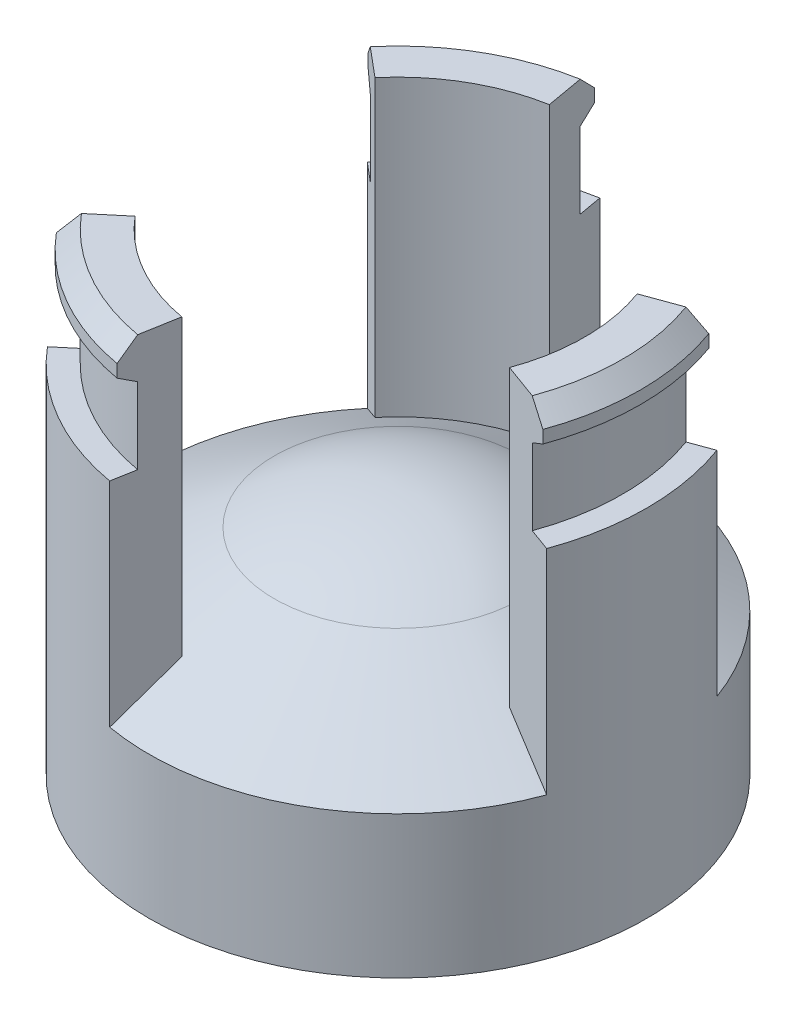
ISO-10303-21;
HEADER;
FILE_DESCRIPTION(('STEP AP214'),'2;1');
FILE_NAME('part.step','',(''),(''),'','','');
FILE_SCHEMA(('AUTOMOTIVE_DESIGN { 1 0 10303 214 1 1 1 1 }'));
ENDSEC;
DATA;
#1=APPLICATION_CONTEXT('core data for automotive mechanical design processes');
#2=APPLICATION_PROTOCOL_DEFINITION('international standard','automotive_design',2000,#1);
#3=PRODUCT_CONTEXT('',#1,'mechanical');
#4=PRODUCT('Part','Part','',(#3));
#5=PRODUCT_RELATED_PRODUCT_CATEGORY('part','',(#4));
#6=PRODUCT_DEFINITION_FORMATION('','',#4);
#7=PRODUCT_DEFINITION_CONTEXT('part definition',#1,'design');
#8=PRODUCT_DEFINITION('design','',#6,#7);
#9=PRODUCT_DEFINITION_SHAPE('','',#8);
#10=(LENGTH_UNIT() NAMED_UNIT(*) SI_UNIT(.MILLI.,.METRE.));
#11=(NAMED_UNIT(*) PLANE_ANGLE_UNIT() SI_UNIT($,.RADIAN.));
#12=(NAMED_UNIT(*) SI_UNIT($,.STERADIAN.) SOLID_ANGLE_UNIT());
#13=UNCERTAINTY_MEASURE_WITH_UNIT(LENGTH_MEASURE(1.E-05),#10,'distance_accuracy_value','');
#14=(GEOMETRIC_REPRESENTATION_CONTEXT(3) GLOBAL_UNCERTAINTY_ASSIGNED_CONTEXT((#13)) GLOBAL_UNIT_ASSIGNED_CONTEXT((#10,
#11,#12)) REPRESENTATION_CONTEXT('',''));
#15=CARTESIAN_POINT('',(0.,0.,0.));
#16=DIRECTION('',(0.,0.,1.));
#17=DIRECTION('',(1.,0.,0.));
#18=AXIS2_PLACEMENT_3D('',#15,#16,#17);
#19=CARTESIAN_POINT('',(0.,0.,0.));
#20=DIRECTION('',(0.,-1.,0.));
#21=DIRECTION('',(1.,0.,0.));
#22=AXIS2_PLACEMENT_3D('',#19,#20,#21);
#23=SPHERICAL_SURFACE('',#22,8.25);
#24=CARTESIAN_POINT('',(0.,0.,0.));
#25=DIRECTION('',(0.,-1.,0.));
#26=DIRECTION('',(0.,0.,-1.));
#27=AXIS2_PLACEMENT_3D('',#24,#25,#26);
#28=CIRCLE('',#27,8.25);
#29=CARTESIAN_POINT('',(0.,0.,-8.25));
#30=VERTEX_POINT('',#29);
#31=EDGE_CURVE('E491',#30,#30,#28,.T.);
#32=ORIENTED_EDGE('',*,*,#31,.T.);
#33=EDGE_LOOP('',(#32));
#34=FACE_BOUND('',#33,.T.);
#35=ADVANCED_FACE('F39',(#34),#23,.F.);
#36=CARTESIAN_POINT('',(0.,0.,0.));
#37=DIRECTION('',(0.,-1.,0.));
#38=DIRECTION('',(1.,0.,0.));
#39=AXIS2_PLACEMENT_3D('',#36,#37,#38);
#40=SPHERICAL_SURFACE('',#39,9.74974226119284);
#41=CARTESIAN_POINT('',(0.,8.44352447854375,0.));
#42=DIRECTION('',(0.,-1.,0.));
#43=DIRECTION('',(0.,0.,-1.));
#44=AXIS2_PLACEMENT_3D('',#41,#42,#43);
#45=CIRCLE('',#44,4.8748711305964);
#46=CARTESIAN_POINT('',(0.,8.44352447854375,-4.8748711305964));
#47=VERTEX_POINT('',#46);
#48=EDGE_CURVE('E503',#47,#47,#45,.T.);
#49=ORIENTED_EDGE('',*,*,#48,.F.);
#50=EDGE_LOOP('',(#49));
#51=FACE_BOUND('',#50,.T.);
#52=ADVANCED_FACE('F606',(#51),#40,.T.);
#53=CARTESIAN_POINT('',(0.,5.6,0.));
#54=DIRECTION('',(0.,-1.,0.));
#55=DIRECTION('',(0.,0.,-1.));
#56=AXIS2_PLACEMENT_3D('',#53,#54,#55);
#57=CONICAL_SURFACE('',#56,9.8,1.0471975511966);
#58=DIRECTION('',(-0.663413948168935,-0.499999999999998,-0.556670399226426));
#59=VECTOR('',#58,1.);
#60=CARTESIAN_POINT('',(0.,11.2580326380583,0.));
#61=LINE('',#60,#59);
#62=CARTESIAN_POINT('',(-7.50723554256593,5.6,-6.29931857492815));
#63=VERTEX_POINT('',#62);
#64=CARTESIAN_POINT('',(-5.63042665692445,7.01450815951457,-4.72448893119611));
#65=VERTEX_POINT('',#64);
#66=EDGE_CURVE('E313',#63,#65,#61,.F.);
#67=ORIENTED_EDGE('',*,*,#66,.F.);
#68=CARTESIAN_POINT('',(0.,5.6,0.));
#69=DIRECTION('',(0.,-1.,0.));
#70=DIRECTION('',(0.,0.,-1.));
#71=AXIS2_PLACEMENT_3D('',#68,#69,#70);
#72=CIRCLE('',#71,9.8);
#73=CARTESIAN_POINT('',(-7.50723554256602,5.6,6.29931857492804));
#74=VERTEX_POINT('',#73);
#75=EDGE_CURVE('E504',#74,#63,#72,.T.);
#76=ORIENTED_EDGE('',*,*,#75,.F.);
#77=DIRECTION('',(-0.663413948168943,-0.499999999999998,0.556670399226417));
#78=VECTOR('',#77,1.);
#79=CARTESIAN_POINT('',(0.,11.2580326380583,0.));
#80=LINE('',#79,#78);
#81=CARTESIAN_POINT('',(-5.63042665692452,7.01450815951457,4.72448893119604));
#82=VERTEX_POINT('',#81);
#83=EDGE_CURVE('E399',#74,#82,#80,.F.);
#84=ORIENTED_EDGE('',*,*,#83,.T.);
#85=CARTESIAN_POINT('',(0.,7.01450815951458,0.));
#86=DIRECTION('',(0.,-1.,0.));
#87=DIRECTION('',(0.,0.,-1.));
#88=AXIS2_PLACEMENT_3D('',#85,#86,#87);
#89=CIRCLE('',#88,7.35);
#90=CARTESIAN_POINT('',(-1.27631410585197,7.01450815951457,7.23833698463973));
#91=VERTEX_POINT('',#90);
#92=EDGE_CURVE('E47',#91,#82,#89,.T.);
#93=ORIENTED_EDGE('',*,*,#92,.F.);
#94=DIRECTION('',(-0.150383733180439,-0.499999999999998,0.852868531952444));
#95=VECTOR('',#94,1.);
#96=CARTESIAN_POINT('',(0.,11.2580326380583,0.));
#97=LINE('',#96,#95);
#98=CARTESIAN_POINT('',(-1.70175214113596,5.6,9.65111597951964));
#99=VERTEX_POINT('',#98);
#100=EDGE_CURVE('E403',#99,#91,#97,.F.);
#101=ORIENTED_EDGE('',*,*,#100,.F.);
#102=CARTESIAN_POINT('',(9.2089876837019,5.6,3.35179740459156));
#103=VERTEX_POINT('',#102);
#104=EDGE_CURVE('E500',#103,#99,#72,.T.);
#105=ORIENTED_EDGE('',*,*,#104,.F.);
#106=DIRECTION('',(0.813797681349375,-0.499999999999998,0.296198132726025));
#107=VECTOR('',#106,1.);
#108=CARTESIAN_POINT('',(0.,11.2580326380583,0.));
#109=LINE('',#108,#107);
#110=CARTESIAN_POINT('',(6.90674076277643,7.01450815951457,2.51384805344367));
#111=VERTEX_POINT('',#110);
#112=EDGE_CURVE('E508',#103,#111,#109,.F.);
#113=ORIENTED_EDGE('',*,*,#112,.T.);
#114=CARTESIAN_POINT('',(0.,7.01450815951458,0.));
#115=DIRECTION('',(0.,-1.,0.));
#116=DIRECTION('',(0.,0.,-1.));
#117=AXIS2_PLACEMENT_3D('',#114,#115,#116);
#118=CIRCLE('',#117,7.35);
#119=CARTESIAN_POINT('',(6.90674076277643,7.01450815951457,-2.51384805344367));
#120=VERTEX_POINT('',#119);
#121=EDGE_CURVE('E512',#120,#111,#118,.T.);
#122=ORIENTED_EDGE('',*,*,#121,.F.);
#123=DIRECTION('',(0.813797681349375,-0.499999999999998,-0.296198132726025));
#124=VECTOR('',#123,1.);
#125=CARTESIAN_POINT('',(0.,11.2580326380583,0.));
#126=LINE('',#125,#124);
#127=CARTESIAN_POINT('',(9.2089876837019,5.6,-3.35179740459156));
#128=VERTEX_POINT('',#127);
#129=EDGE_CURVE('E515',#128,#120,#126,.F.);
#130=ORIENTED_EDGE('',*,*,#129,.F.);
#131=CARTESIAN_POINT('',(-1.70175214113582,5.6,-9.65111597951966));
#132=VERTEX_POINT('',#131);
#133=EDGE_CURVE('E499',#132,#128,#72,.T.);
#134=ORIENTED_EDGE('',*,*,#133,.F.);
#135=DIRECTION('',(-0.150383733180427,-0.499999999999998,-0.852868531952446));
#136=VECTOR('',#135,1.);
#137=CARTESIAN_POINT('',(0.,11.2580326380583,0.));
#138=LINE('',#137,#136);
#139=CARTESIAN_POINT('',(-1.27631410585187,7.01450815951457,-7.23833698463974));
#140=VERTEX_POINT('',#139);
#141=EDGE_CURVE('E236',#132,#140,#138,.F.);
#142=ORIENTED_EDGE('',*,*,#141,.T.);
#143=CARTESIAN_POINT('',(0.,7.01450815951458,0.));
#144=DIRECTION('',(0.,-1.,0.));
#145=DIRECTION('',(0.,0.,-1.));
#146=AXIS2_PLACEMENT_3D('',#143,#144,#145);
#147=CIRCLE('',#146,7.35);
#148=EDGE_CURVE('E11',#65,#140,#147,.T.);
#149=ORIENTED_EDGE('',*,*,#148,.F.);
#150=EDGE_LOOP('',(#67,#76,#84,#93,#101,#105,#113,#122,#130,#134,#142,#149));
#151=FACE_BOUND('',#150,.T.);
#152=ORIENTED_EDGE('',*,*,#48,.T.);
#153=EDGE_LOOP('',(#152));
#154=FACE_BOUND('',#153,.T.);
#155=ADVANCED_FACE('F530',(#151,#154),#57,.T.);
#156=CARTESIAN_POINT('',(0.,8.25,0.));
#157=DIRECTION('',(0.,-1.,0.));
#158=DIRECTION('',(0.,0.,-1.));
#159=AXIS2_PLACEMENT_3D('',#156,#157,#158);
#160=CYLINDRICAL_SURFACE('',#159,9.8);
#161=ORIENTED_EDGE('',*,*,#104,.T.);
#162=DIRECTION('',(0.,1.,0.));
#163=VECTOR('',#162,1.);
#164=CARTESIAN_POINT('',(-1.70175214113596,14.,9.65111597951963));
#165=LINE('',#164,#163);
#166=CARTESIAN_POINT('',(-1.70175214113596,14.,9.65111597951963));
#167=VERTEX_POINT('',#166);
#168=EDGE_CURVE('E346',#99,#167,#165,.T.);
#169=ORIENTED_EDGE('',*,*,#168,.T.);
#170=CARTESIAN_POINT('',(0.,14.,0.));
#171=DIRECTION('',(0.,-1.,0.));
#172=DIRECTION('',(0.866025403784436,0.,0.500000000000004));
#173=AXIS2_PLACEMENT_3D('',#170,#171,#172);
#174=CIRCLE('',#173,9.8);
#175=CARTESIAN_POINT('',(-7.50723554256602,14.,6.29931857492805));
#176=VERTEX_POINT('',#175);
#177=EDGE_CURVE('E378',#167,#176,#174,.T.);
#178=ORIENTED_EDGE('',*,*,#177,.T.);
#179=DIRECTION('',(0.,1.,0.));
#180=VECTOR('',#179,1.);
#181=CARTESIAN_POINT('',(-7.50723554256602,14.,6.29931857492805));
#182=LINE('',#181,#180);
#183=EDGE_CURVE('E61',#74,#176,#182,.T.);
#184=ORIENTED_EDGE('',*,*,#183,.F.);
#185=ORIENTED_EDGE('',*,*,#75,.T.);
#186=DIRECTION('',(0.,1.,0.));
#187=VECTOR('',#186,1.);
#188=CARTESIAN_POINT('',(-7.50723554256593,14.,-6.29931857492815));
#189=LINE('',#188,#187);
#190=CARTESIAN_POINT('',(-7.50723554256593,14.,-6.29931857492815));
#191=VERTEX_POINT('',#190);
#192=EDGE_CURVE('E219',#63,#191,#189,.T.);
#193=ORIENTED_EDGE('',*,*,#192,.T.);
#194=CARTESIAN_POINT('',(0.,14.,0.));
#195=DIRECTION('',(0.,-1.,0.));
#196=DIRECTION('',(-0.866025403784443,0.,0.499999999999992));
#197=AXIS2_PLACEMENT_3D('',#194,#195,#196);
#198=CIRCLE('',#197,9.8);
#199=CARTESIAN_POINT('',(-1.70175214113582,14.,-9.65111597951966));
#200=VERTEX_POINT('',#199);
#201=EDGE_CURVE('E215',#191,#200,#198,.T.);
#202=ORIENTED_EDGE('',*,*,#201,.T.);
#203=DIRECTION('',(0.,1.,0.));
#204=VECTOR('',#203,1.);
#205=CARTESIAN_POINT('',(-1.70175214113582,14.,-9.65111597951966));
#206=LINE('',#205,#204);
#207=EDGE_CURVE('E54',#132,#200,#206,.T.);
#208=ORIENTED_EDGE('',*,*,#207,.F.);
#209=ORIENTED_EDGE('',*,*,#133,.T.);
#210=DIRECTION('',(0.,1.,0.));
#211=VECTOR('',#210,1.);
#212=CARTESIAN_POINT('',(9.2089876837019,14.,-3.35179740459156));
#213=LINE('',#212,#211);
#214=CARTESIAN_POINT('',(9.2089876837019,14.,-3.35179740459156));
#215=VERTEX_POINT('',#214);
#216=EDGE_CURVE('E438',#128,#215,#213,.T.);
#217=ORIENTED_EDGE('',*,*,#216,.T.);
#218=CARTESIAN_POINT('',(0.,14.,0.));
#219=DIRECTION('',(0.,-1.,0.));
#220=DIRECTION('',(0.,0.,-1.));
#221=AXIS2_PLACEMENT_3D('',#218,#219,#220);
#222=CIRCLE('',#221,9.8);
#223=CARTESIAN_POINT('',(9.2089876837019,14.,3.35179740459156));
#224=VERTEX_POINT('',#223);
#225=EDGE_CURVE('E470',#215,#224,#222,.T.);
#226=ORIENTED_EDGE('',*,*,#225,.T.);
#227=DIRECTION('',(0.,1.,0.));
#228=VECTOR('',#227,1.);
#229=CARTESIAN_POINT('',(9.2089876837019,14.,3.35179740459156));
#230=LINE('',#229,#228);
#231=EDGE_CURVE('E406',#103,#224,#230,.T.);
#232=ORIENTED_EDGE('',*,*,#231,.F.);
#233=EDGE_LOOP('',(#161,#169,#178,#184,#185,#193,#202,#208,#209,#217,#226,#232));
#234=FACE_BOUND('',#233,.T.);
#235=CARTESIAN_POINT('',(0.,0.,0.));
#236=DIRECTION('',(0.,-1.,0.));
#237=DIRECTION('',(0.,0.,-1.));
#238=AXIS2_PLACEMENT_3D('',#235,#236,#237);
#239=CIRCLE('',#238,9.8);
#240=CARTESIAN_POINT('',(0.,0.,-9.8));
#241=VERTEX_POINT('',#240);
#242=EDGE_CURVE('E495',#241,#241,#239,.T.);
#243=ORIENTED_EDGE('',*,*,#242,.F.);
#244=EDGE_LOOP('',(#243));
#245=FACE_BOUND('',#244,.T.);
#246=ADVANCED_FACE('F217',(#234,#245),#160,.T.);
#247=CARTESIAN_POINT('',(8.25,0.,0.));
#248=DIRECTION('',(0.,-1.,0.));
#249=DIRECTION('',(0.,0.,-1.));
#250=AXIS2_PLACEMENT_3D('',#247,#248,#249);
#251=PLANE('',#250);
#252=ORIENTED_EDGE('',*,*,#242,.T.);
#253=EDGE_LOOP('',(#252));
#254=FACE_BOUND('',#253,.T.);
#255=ORIENTED_EDGE('',*,*,#31,.F.);
#256=EDGE_LOOP('',(#255));
#257=FACE_BOUND('',#256,.T.);
#258=ADVANCED_FACE('F614',(#254,#257),#251,.T.);
#259=CARTESIAN_POINT('',(0.,0.,0.));
#260=DIRECTION('',(0.,-1.,0.));
#261=DIRECTION('',(0.,0.,-1.));
#262=AXIS2_PLACEMENT_3D('',#259,#260,#261);
#263=CYLINDRICAL_SURFACE('',#262,7.35);
#264=DIRECTION('',(0.,-1.,0.));
#265=VECTOR('',#264,1.);
#266=CARTESIAN_POINT('',(6.90674076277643,6.6,-2.51384805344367));
#267=LINE('',#266,#265);
#268=CARTESIAN_POINT('',(6.90674076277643,18.6041451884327,-2.51384805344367));
#269=VERTEX_POINT('',#268);
#270=EDGE_CURVE('E466',#269,#120,#267,.T.);
#271=ORIENTED_EDGE('',*,*,#270,.T.);
#272=ORIENTED_EDGE('',*,*,#121,.T.);
#273=DIRECTION('',(0.,-1.,0.));
#274=VECTOR('',#273,1.);
#275=CARTESIAN_POINT('',(6.90674076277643,6.6,2.51384805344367));
#276=LINE('',#275,#274);
#277=CARTESIAN_POINT('',(6.90674076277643,18.6041451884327,2.51384805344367));
#278=VERTEX_POINT('',#277);
#279=EDGE_CURVE('E434',#278,#111,#276,.T.);
#280=ORIENTED_EDGE('',*,*,#279,.F.);
#281=CARTESIAN_POINT('',(0.,18.6041451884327,0.));
#282=DIRECTION('',(0.,-1.,0.));
#283=DIRECTION('',(0.,0.,-1.));
#284=AXIS2_PLACEMENT_3D('',#281,#282,#283);
#285=CIRCLE('',#284,7.35);
#286=EDGE_CURVE('E488',#269,#278,#285,.T.);
#287=ORIENTED_EDGE('',*,*,#286,.F.);
#288=EDGE_LOOP('',(#271,#272,#280,#287));
#289=FACE_BOUND('',#288,.T.);
#290=ADVANCED_FACE('F547',(#289),#263,.F.);
#291=CARTESIAN_POINT('',(6.90674076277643,18.6041451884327,-2.51384805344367));
#292=DIRECTION('',(0.,1.,0.));
#293=DIRECTION('',(0.,0.,1.));
#294=AXIS2_PLACEMENT_3D('',#291,#292,#293);
#295=PLANE('',#294);
#296=CARTESIAN_POINT('',(0.,18.6041451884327,0.));
#297=DIRECTION('',(0.,-1.,0.));
#298=DIRECTION('',(0.,0.,-1.));
#299=AXIS2_PLACEMENT_3D('',#296,#297,#298);
#300=CIRCLE('',#299,8.85);
#301=CARTESIAN_POINT('',(8.31627969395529,18.6041451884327,-3.02687826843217));
#302=VERTEX_POINT('',#301);
#303=CARTESIAN_POINT('',(8.31627969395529,18.6041451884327,3.02687826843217));
#304=VERTEX_POINT('',#303);
#305=EDGE_CURVE('E485',#302,#304,#300,.T.);
#306=ORIENTED_EDGE('',*,*,#305,.F.);
#307=DIRECTION('',(-0.939692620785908,0.,0.342020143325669));
#308=VECTOR('',#307,1.);
#309=CARTESIAN_POINT('',(6.90674076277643,18.6041451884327,-2.51384805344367));
#310=LINE('',#309,#308);
#311=EDGE_CURVE('E462',#302,#269,#310,.T.);
#312=ORIENTED_EDGE('',*,*,#311,.T.);
#313=ORIENTED_EDGE('',*,*,#286,.T.);
#314=DIRECTION('',(-0.939692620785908,0.,-0.342020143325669));
#315=VECTOR('',#314,1.);
#316=CARTESIAN_POINT('',(6.90674076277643,18.6041451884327,2.51384805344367));
#317=LINE('',#316,#315);
#318=EDGE_CURVE('E430',#304,#278,#317,.T.);
#319=ORIENTED_EDGE('',*,*,#318,.F.);
#320=EDGE_LOOP('',(#306,#312,#313,#319));
#321=FACE_BOUND('',#320,.T.);
#322=ADVANCED_FACE('F553',(#321),#295,.T.);
#323=CARTESIAN_POINT('',(0.,17.9041451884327,0.));
#324=DIRECTION('',(0.,-1.,0.));
#325=DIRECTION('',(0.,0.,-1.));
#326=AXIS2_PLACEMENT_3D('',#323,#324,#325);
#327=CONICAL_SURFACE('',#326,9.55,0.785398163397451);
#328=CARTESIAN_POINT('',(0.,17.9041451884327,0.));
#329=DIRECTION('',(0.,-1.,0.));
#330=DIRECTION('',(0.,0.,-1.));
#331=AXIS2_PLACEMENT_3D('',#328,#329,#330);
#332=CIRCLE('',#331,9.55);
#333=CARTESIAN_POINT('',(8.97406452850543,17.9041451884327,-3.26629236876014));
#334=VERTEX_POINT('',#333);
#335=CARTESIAN_POINT('',(8.97406452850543,17.9041451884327,3.26629236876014));
#336=VERTEX_POINT('',#335);
#337=EDGE_CURVE('E482',#334,#336,#332,.T.);
#338=ORIENTED_EDGE('',*,*,#337,.F.);
#339=DIRECTION('',(-0.664463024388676,0.707106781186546,0.241844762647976));
#340=VECTOR('',#339,1.);
#341=CARTESIAN_POINT('',(8.31627969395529,18.6041451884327,-3.02687826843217));
#342=LINE('',#341,#340);
#343=EDGE_CURVE('E458',#334,#302,#342,.T.);
#344=ORIENTED_EDGE('',*,*,#343,.T.);
#345=ORIENTED_EDGE('',*,*,#305,.T.);
#346=DIRECTION('',(-0.664463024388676,0.707106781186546,-0.241844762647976));
#347=VECTOR('',#346,1.);
#348=CARTESIAN_POINT('',(8.31627969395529,18.6041451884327,3.02687826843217));
#349=LINE('',#348,#347);
#350=EDGE_CURVE('E426',#336,#304,#349,.T.);
#351=ORIENTED_EDGE('',*,*,#350,.F.);
#352=EDGE_LOOP('',(#338,#344,#345,#351));
#353=FACE_BOUND('',#352,.T.);
#354=ADVANCED_FACE('F559',(#353),#327,.T.);
#355=CARTESIAN_POINT('',(0.,0.,0.));
#356=DIRECTION('',(0.,-1.,0.));
#357=DIRECTION('',(0.,0.,-1.));
#358=AXIS2_PLACEMENT_3D('',#355,#356,#357);
#359=CYLINDRICAL_SURFACE('',#358,9.55);
#360=CARTESIAN_POINT('',(0.,17.4041451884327,0.));
#361=DIRECTION('',(0.,-1.,0.));
#362=DIRECTION('',(0.,0.,-1.));
#363=AXIS2_PLACEMENT_3D('',#360,#361,#362);
#364=CIRCLE('',#363,9.55);
#365=CARTESIAN_POINT('',(8.97406452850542,17.4041451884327,-3.26629236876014));
#366=VERTEX_POINT('',#365);
#367=CARTESIAN_POINT('',(8.97406452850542,17.4041451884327,3.26629236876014));
#368=VERTEX_POINT('',#367);
#369=EDGE_CURVE('E479',#366,#368,#364,.T.);
#370=ORIENTED_EDGE('',*,*,#369,.F.);
#371=DIRECTION('',(0.,1.,0.));
#372=VECTOR('',#371,1.);
#373=CARTESIAN_POINT('',(8.97406452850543,17.9041451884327,-3.26629236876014));
#374=LINE('',#373,#372);
#375=EDGE_CURVE('E454',#366,#334,#374,.T.);
#376=ORIENTED_EDGE('',*,*,#375,.T.);
#377=ORIENTED_EDGE('',*,*,#337,.T.);
#378=DIRECTION('',(0.,1.,0.));
#379=VECTOR('',#378,1.);
#380=CARTESIAN_POINT('',(8.97406452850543,17.9041451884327,3.26629236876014));
#381=LINE('',#380,#379);
#382=EDGE_CURVE('E422',#368,#336,#381,.T.);
#383=ORIENTED_EDGE('',*,*,#382,.F.);
#384=EDGE_LOOP('',(#370,#376,#377,#383));
#385=FACE_BOUND('',#384,.T.);
#386=ADVANCED_FACE('F562',(#385),#359,.T.);
#387=CARTESIAN_POINT('',(0.,17.,0.));
#388=DIRECTION('',(0.,1.,0.));
#389=DIRECTION('',(0.,0.,1.));
#390=AXIS2_PLACEMENT_3D('',#387,#388,#389);
#391=CONICAL_SURFACE('',#390,8.85,1.0471975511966);
#392=CARTESIAN_POINT('',(0.,17.,0.));
#393=DIRECTION('',(0.,-1.,0.));
#394=DIRECTION('',(0.,0.,-1.));
#395=AXIS2_PLACEMENT_3D('',#392,#393,#394);
#396=CIRCLE('',#395,8.85);
#397=CARTESIAN_POINT('',(8.31627969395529,17.,-3.02687826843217));
#398=VERTEX_POINT('',#397);
#399=CARTESIAN_POINT('',(8.31627969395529,17.,3.02687826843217));
#400=VERTEX_POINT('',#399);
#401=EDGE_CURVE('E476',#398,#400,#396,.T.);
#402=ORIENTED_EDGE('',*,*,#401,.F.);
#403=DIRECTION('',(0.813797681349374,0.499999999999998,-0.296198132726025));
#404=VECTOR('',#403,1.);
#405=CARTESIAN_POINT('',(8.97406452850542,17.4041451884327,-3.26629236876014));
#406=LINE('',#405,#404);
#407=EDGE_CURVE('E450',#398,#366,#406,.T.);
#408=ORIENTED_EDGE('',*,*,#407,.T.);
#409=ORIENTED_EDGE('',*,*,#369,.T.);
#410=DIRECTION('',(0.813797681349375,0.499999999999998,0.296198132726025));
#411=VECTOR('',#410,1.);
#412=CARTESIAN_POINT('',(8.97406452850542,17.4041451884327,3.26629236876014));
#413=LINE('',#412,#411);
#414=EDGE_CURVE('E418',#400,#368,#413,.T.);
#415=ORIENTED_EDGE('',*,*,#414,.F.);
#416=EDGE_LOOP('',(#402,#408,#409,#415));
#417=FACE_BOUND('',#416,.T.);
#418=ADVANCED_FACE('F565',(#417),#391,.T.);
#419=CARTESIAN_POINT('',(0.,0.,0.));
#420=DIRECTION('',(0.,-1.,0.));
#421=DIRECTION('',(0.,0.,-1.));
#422=AXIS2_PLACEMENT_3D('',#419,#420,#421);
#423=CYLINDRICAL_SURFACE('',#422,8.85);
#424=CARTESIAN_POINT('',(0.,14.,0.));
#425=DIRECTION('',(0.,-1.,0.));
#426=DIRECTION('',(0.,0.,-1.));
#427=AXIS2_PLACEMENT_3D('',#424,#425,#426);
#428=CIRCLE('',#427,8.85);
#429=CARTESIAN_POINT('',(8.31627969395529,14.,-3.02687826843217));
#430=VERTEX_POINT('',#429);
#431=CARTESIAN_POINT('',(8.31627969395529,14.,3.02687826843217));
#432=VERTEX_POINT('',#431);
#433=EDGE_CURVE('E473',#430,#432,#428,.T.);
#434=ORIENTED_EDGE('',*,*,#433,.F.);
#435=DIRECTION('',(0.,1.,0.));
#436=VECTOR('',#435,1.);
#437=CARTESIAN_POINT('',(8.31627969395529,17.,-3.02687826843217));
#438=LINE('',#437,#436);
#439=EDGE_CURVE('E446',#430,#398,#438,.T.);
#440=ORIENTED_EDGE('',*,*,#439,.T.);
#441=ORIENTED_EDGE('',*,*,#401,.T.);
#442=DIRECTION('',(0.,1.,0.));
#443=VECTOR('',#442,1.);
#444=CARTESIAN_POINT('',(8.31627969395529,17.,3.02687826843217));
#445=LINE('',#444,#443);
#446=EDGE_CURVE('E414',#432,#400,#445,.T.);
#447=ORIENTED_EDGE('',*,*,#446,.F.);
#448=EDGE_LOOP('',(#434,#440,#441,#447));
#449=FACE_BOUND('',#448,.T.);
#450=ADVANCED_FACE('F567',(#449),#423,.T.);
#451=CARTESIAN_POINT('',(8.31627969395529,14.,-3.02687826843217));
#452=DIRECTION('',(0.,1.,0.));
#453=DIRECTION('',(0.,0.,1.));
#454=AXIS2_PLACEMENT_3D('',#451,#452,#453);
#455=PLANE('',#454);
#456=ORIENTED_EDGE('',*,*,#225,.F.);
#457=DIRECTION('',(-0.939692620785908,0.,0.342020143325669));
#458=VECTOR('',#457,1.);
#459=CARTESIAN_POINT('',(8.31627969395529,14.,-3.02687826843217));
#460=LINE('',#459,#458);
#461=EDGE_CURVE('E442',#215,#430,#460,.T.);
#462=ORIENTED_EDGE('',*,*,#461,.T.);
#463=ORIENTED_EDGE('',*,*,#433,.T.);
#464=DIRECTION('',(-0.939692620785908,0.,-0.342020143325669));
#465=VECTOR('',#464,1.);
#466=CARTESIAN_POINT('',(8.31627969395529,14.,3.02687826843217));
#467=LINE('',#466,#465);
#468=EDGE_CURVE('E410',#224,#432,#467,.T.);
#469=ORIENTED_EDGE('',*,*,#468,.F.);
#470=EDGE_LOOP('',(#456,#462,#463,#469));
#471=FACE_BOUND('',#470,.T.);
#472=ADVANCED_FACE('F571',(#471),#455,.T.);
#473=CARTESIAN_POINT('',(0.,0.,0.));
#474=DIRECTION('',(-0.342020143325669,0.,-0.939692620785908));
#475=DIRECTION('',(-0.939692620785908,0.,0.342020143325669));
#476=AXIS2_PLACEMENT_3D('',#473,#474,#475);
#477=PLANE('',#476);
#478=ORIENTED_EDGE('',*,*,#216,.F.);
#479=ORIENTED_EDGE('',*,*,#129,.T.);
#480=ORIENTED_EDGE('',*,*,#270,.F.);
#481=ORIENTED_EDGE('',*,*,#311,.F.);
#482=ORIENTED_EDGE('',*,*,#343,.F.);
#483=ORIENTED_EDGE('',*,*,#375,.F.);
#484=ORIENTED_EDGE('',*,*,#407,.F.);
#485=ORIENTED_EDGE('',*,*,#439,.F.);
#486=ORIENTED_EDGE('',*,*,#461,.F.);
#487=EDGE_LOOP('',(#478,#479,#480,#481,#482,#483,#484,#485,#486));
#488=FACE_BOUND('',#487,.T.);
#489=ADVANCED_FACE('F539',(#488),#477,.T.);
#490=CARTESIAN_POINT('',(0.,0.,0.));
#491=DIRECTION('',(0.342020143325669,0.,-0.939692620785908));
#492=DIRECTION('',(-0.939692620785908,0.,-0.342020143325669));
#493=AXIS2_PLACEMENT_3D('',#490,#491,#492);
#494=PLANE('',#493);
#495=ORIENTED_EDGE('',*,*,#112,.F.);
#496=ORIENTED_EDGE('',*,*,#231,.T.);
#497=ORIENTED_EDGE('',*,*,#468,.T.);
#498=ORIENTED_EDGE('',*,*,#446,.T.);
#499=ORIENTED_EDGE('',*,*,#414,.T.);
#500=ORIENTED_EDGE('',*,*,#382,.T.);
#501=ORIENTED_EDGE('',*,*,#350,.T.);
#502=ORIENTED_EDGE('',*,*,#318,.T.);
#503=ORIENTED_EDGE('',*,*,#279,.T.);
#504=EDGE_LOOP('',(#495,#496,#497,#498,#499,#500,#501,#502,#503));
#505=FACE_BOUND('',#504,.T.);
#506=ADVANCED_FACE('F549',(#505),#494,.F.);
#507=CARTESIAN_POINT('',(0.,0.,0.));
#508=DIRECTION('',(0.,-1.,0.));
#509=DIRECTION('',(0.866025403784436,0.,0.500000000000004));
#510=AXIS2_PLACEMENT_3D('',#507,#508,#509);
#511=CYLINDRICAL_SURFACE('',#510,7.35);
#512=DIRECTION('',(0.,-1.,0.));
#513=VECTOR('',#512,1.);
#514=CARTESIAN_POINT('',(-1.27631410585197,6.6,7.23833698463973));
#515=LINE('',#514,#513);
#516=CARTESIAN_POINT('',(-1.27631410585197,18.6041451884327,7.23833698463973));
#517=VERTEX_POINT('',#516);
#518=EDGE_CURVE('E374',#517,#91,#515,.T.);
#519=ORIENTED_EDGE('',*,*,#518,.T.);
#520=ORIENTED_EDGE('',*,*,#92,.T.);
#521=DIRECTION('',(0.,-1.,0.));
#522=VECTOR('',#521,1.);
#523=CARTESIAN_POINT('',(-5.63042665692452,6.6,4.72448893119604));
#524=LINE('',#523,#522);
#525=CARTESIAN_POINT('',(-5.63042665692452,18.6041451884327,4.72448893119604));
#526=VERTEX_POINT('',#525);
#527=EDGE_CURVE('E342',#526,#82,#524,.T.);
#528=ORIENTED_EDGE('',*,*,#527,.F.);
#529=CARTESIAN_POINT('',(0.,18.6041451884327,0.));
#530=DIRECTION('',(0.,-1.,0.));
#531=DIRECTION('',(0.866025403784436,0.,0.500000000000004));
#532=AXIS2_PLACEMENT_3D('',#529,#530,#531);
#533=CIRCLE('',#532,7.35);
#534=EDGE_CURVE('E396',#517,#526,#533,.T.);
#535=ORIENTED_EDGE('',*,*,#534,.F.);
#536=EDGE_LOOP('',(#519,#520,#528,#535));
#537=FACE_BOUND('',#536,.T.);
#538=ADVANCED_FACE('F521',(#537),#511,.F.);
#539=CARTESIAN_POINT('',(-1.27631410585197,18.6041451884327,7.23833698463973));
#540=DIRECTION('',(0.,1.,0.));
#541=DIRECTION('',(-0.866025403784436,0.,-0.500000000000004));
#542=AXIS2_PLACEMENT_3D('',#539,#540,#541);
#543=PLANE('',#542);
#544=CARTESIAN_POINT('',(0.,18.6041451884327,0.));
#545=DIRECTION('',(0.,-1.,0.));
#546=DIRECTION('',(0.866025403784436,0.,0.500000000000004));
#547=AXIS2_PLACEMENT_3D('',#544,#545,#546);
#548=CIRCLE('',#547,8.85);
#549=CARTESIAN_POINT('',(-1.53678637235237,18.6041451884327,8.71554861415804));
#550=VERTEX_POINT('',#549);
#551=CARTESIAN_POINT('',(-6.77949332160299,18.6041451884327,5.68867034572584));
#552=VERTEX_POINT('',#551);
#553=EDGE_CURVE('E393',#550,#552,#548,.T.);
#554=ORIENTED_EDGE('',*,*,#553,.F.);
#555=DIRECTION('',(0.173648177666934,0.,-0.984807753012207));
#556=VECTOR('',#555,1.);
#557=CARTESIAN_POINT('',(-1.27631410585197,18.6041451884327,7.23833698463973));
#558=LINE('',#557,#556);
#559=EDGE_CURVE('E370',#550,#517,#558,.T.);
#560=ORIENTED_EDGE('',*,*,#559,.T.);
#561=ORIENTED_EDGE('',*,*,#534,.T.);
#562=DIRECTION('',(0.766044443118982,0.,-0.642787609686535));
#563=VECTOR('',#562,1.);
#564=CARTESIAN_POINT('',(-5.63042665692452,18.6041451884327,4.72448893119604));
#565=LINE('',#564,#563);
#566=EDGE_CURVE('E338',#552,#526,#565,.T.);
#567=ORIENTED_EDGE('',*,*,#566,.F.);
#568=EDGE_LOOP('',(#554,#560,#561,#567));
#569=FACE_BOUND('',#568,.T.);
#570=ADVANCED_FACE('F596',(#569),#543,.T.);
#571=CARTESIAN_POINT('',(0.,17.9041451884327,0.));
#572=DIRECTION('',(0.,-1.,0.));
#573=DIRECTION('',(0.866025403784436,0.,0.500000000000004));
#574=AXIS2_PLACEMENT_3D('',#571,#572,#573);
#575=CONICAL_SURFACE('',#574,9.55,0.785398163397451);
#576=CARTESIAN_POINT('',(0.,17.9041451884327,0.));
#577=DIRECTION('',(0.,-1.,0.));
#578=DIRECTION('',(0.866025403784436,0.,0.500000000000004));
#579=AXIS2_PLACEMENT_3D('',#576,#577,#578);
#580=CIRCLE('',#579,9.55);
#581=CARTESIAN_POINT('',(-1.65834009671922,17.9041451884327,9.40491404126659));
#582=VERTEX_POINT('',#581);
#583=CARTESIAN_POINT('',(-7.31572443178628,17.9041451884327,6.13862167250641));
#584=VERTEX_POINT('',#583);
#585=EDGE_CURVE('E390',#582,#584,#580,.T.);
#586=ORIENTED_EDGE('',*,*,#585,.F.);
#587=DIRECTION('',(0.122787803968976,0.707106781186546,-0.69636424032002));
#588=VECTOR('',#587,1.);
#589=CARTESIAN_POINT('',(-1.53678637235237,18.6041451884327,8.71554861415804));
#590=LINE('',#589,#588);
#591=EDGE_CURVE('E366',#582,#550,#590,.T.);
#592=ORIENTED_EDGE('',*,*,#591,.T.);
#593=ORIENTED_EDGE('',*,*,#553,.T.);
#594=DIRECTION('',(0.541675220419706,0.707106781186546,-0.454519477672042));
#595=VECTOR('',#594,1.);
#596=CARTESIAN_POINT('',(-6.77949332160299,18.6041451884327,5.68867034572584));
#597=LINE('',#596,#595);
#598=EDGE_CURVE('E334',#584,#552,#597,.T.);
#599=ORIENTED_EDGE('',*,*,#598,.F.);
#600=EDGE_LOOP('',(#586,#592,#593,#599));
#601=FACE_BOUND('',#600,.T.);
#602=ADVANCED_FACE('F594',(#601),#575,.T.);
#603=CARTESIAN_POINT('',(0.,0.,0.));
#604=DIRECTION('',(0.,-1.,0.));
#605=DIRECTION('',(0.866025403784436,0.,0.500000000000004));
#606=AXIS2_PLACEMENT_3D('',#603,#604,#605);
#607=CYLINDRICAL_SURFACE('',#606,9.55);
#608=CARTESIAN_POINT('',(0.,17.4041451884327,0.));
#609=DIRECTION('',(0.,-1.,0.));
#610=DIRECTION('',(0.866025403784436,0.,0.500000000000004));
#611=AXIS2_PLACEMENT_3D('',#608,#609,#610);
#612=CIRCLE('',#611,9.55);
#613=CARTESIAN_POINT('',(-1.65834009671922,17.4041451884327,9.40491404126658));
#614=VERTEX_POINT('',#613);
#615=CARTESIAN_POINT('',(-7.31572443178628,17.4041451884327,6.13862167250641));
#616=VERTEX_POINT('',#615);
#617=EDGE_CURVE('E387',#614,#616,#612,.T.);
#618=ORIENTED_EDGE('',*,*,#617,.F.);
#619=DIRECTION('',(0.,1.,0.));
#620=VECTOR('',#619,1.);
#621=CARTESIAN_POINT('',(-1.65834009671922,17.9041451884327,9.40491404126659));
#622=LINE('',#621,#620);
#623=EDGE_CURVE('E362',#614,#582,#622,.T.);
#624=ORIENTED_EDGE('',*,*,#623,.T.);
#625=ORIENTED_EDGE('',*,*,#585,.T.);
#626=DIRECTION('',(0.,1.,0.));
#627=VECTOR('',#626,1.);
#628=CARTESIAN_POINT('',(-7.31572443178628,17.9041451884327,6.13862167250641));
#629=LINE('',#628,#627);
#630=EDGE_CURVE('E330',#616,#584,#629,.T.);
#631=ORIENTED_EDGE('',*,*,#630,.F.);
#632=EDGE_LOOP('',(#618,#624,#625,#631));
#633=FACE_BOUND('',#632,.T.);
#634=ADVANCED_FACE('F591',(#633),#607,.T.);
#635=CARTESIAN_POINT('',(0.,17.,0.));
#636=DIRECTION('',(0.,1.,0.));
#637=DIRECTION('',(-0.866025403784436,0.,-0.500000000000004));
#638=AXIS2_PLACEMENT_3D('',#635,#636,#637);
#639=CONICAL_SURFACE('',#638,8.85,1.0471975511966);
#640=CARTESIAN_POINT('',(0.,17.,0.));
#641=DIRECTION('',(0.,-1.,0.));
#642=DIRECTION('',(0.866025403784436,0.,0.500000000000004));
#643=AXIS2_PLACEMENT_3D('',#640,#641,#642);
#644=CIRCLE('',#643,8.85);
#645=CARTESIAN_POINT('',(-1.53678637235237,17.,8.71554861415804));
#646=VERTEX_POINT('',#645);
#647=CARTESIAN_POINT('',(-6.77949332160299,17.,5.68867034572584));
#648=VERTEX_POINT('',#647);
#649=EDGE_CURVE('E384',#646,#648,#644,.T.);
#650=ORIENTED_EDGE('',*,*,#649,.F.);
#651=DIRECTION('',(-0.150383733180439,0.499999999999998,0.852868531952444));
#652=VECTOR('',#651,1.);
#653=CARTESIAN_POINT('',(-1.65834009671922,17.4041451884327,9.40491404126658));
#654=LINE('',#653,#652);
#655=EDGE_CURVE('E358',#646,#614,#654,.T.);
#656=ORIENTED_EDGE('',*,*,#655,.T.);
#657=ORIENTED_EDGE('',*,*,#617,.T.);
#658=DIRECTION('',(-0.663413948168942,0.499999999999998,0.556670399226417));
#659=VECTOR('',#658,1.);
#660=CARTESIAN_POINT('',(-7.31572443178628,17.4041451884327,6.13862167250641));
#661=LINE('',#660,#659);
#662=EDGE_CURVE('E326',#648,#616,#661,.T.);
#663=ORIENTED_EDGE('',*,*,#662,.F.);
#664=EDGE_LOOP('',(#650,#656,#657,#663));
#665=FACE_BOUND('',#664,.T.);
#666=ADVANCED_FACE('F586',(#665),#639,.T.);
#667=CARTESIAN_POINT('',(0.,0.,0.));
#668=DIRECTION('',(0.,-1.,0.));
#669=DIRECTION('',(0.866025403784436,0.,0.500000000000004));
#670=AXIS2_PLACEMENT_3D('',#667,#668,#669);
#671=CYLINDRICAL_SURFACE('',#670,8.85);
#672=CARTESIAN_POINT('',(0.,14.,0.));
#673=DIRECTION('',(0.,-1.,0.));
#674=DIRECTION('',(0.866025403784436,0.,0.500000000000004));
#675=AXIS2_PLACEMENT_3D('',#672,#673,#674);
#676=CIRCLE('',#675,8.85);
#677=CARTESIAN_POINT('',(-1.53678637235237,14.,8.71554861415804));
#678=VERTEX_POINT('',#677);
#679=CARTESIAN_POINT('',(-6.77949332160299,14.,5.68867034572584));
#680=VERTEX_POINT('',#679);
#681=EDGE_CURVE('E381',#678,#680,#676,.T.);
#682=ORIENTED_EDGE('',*,*,#681,.F.);
#683=DIRECTION('',(0.,1.,0.));
#684=VECTOR('',#683,1.);
#685=CARTESIAN_POINT('',(-1.53678637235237,17.,8.71554861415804));
#686=LINE('',#685,#684);
#687=EDGE_CURVE('E354',#678,#646,#686,.T.);
#688=ORIENTED_EDGE('',*,*,#687,.T.);
#689=ORIENTED_EDGE('',*,*,#649,.T.);
#690=DIRECTION('',(0.,1.,0.));
#691=VECTOR('',#690,1.);
#692=CARTESIAN_POINT('',(-6.77949332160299,17.,5.68867034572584));
#693=LINE('',#692,#691);
#694=EDGE_CURVE('E322',#680,#648,#693,.T.);
#695=ORIENTED_EDGE('',*,*,#694,.F.);
#696=EDGE_LOOP('',(#682,#688,#689,#695));
#697=FACE_BOUND('',#696,.T.);
#698=ADVANCED_FACE('F584',(#697),#671,.T.);
#699=CARTESIAN_POINT('',(-1.53678637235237,14.,8.71554861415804));
#700=DIRECTION('',(0.,1.,0.));
#701=DIRECTION('',(-0.866025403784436,0.,-0.500000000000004));
#702=AXIS2_PLACEMENT_3D('',#699,#700,#701);
#703=PLANE('',#702);
#704=ORIENTED_EDGE('',*,*,#177,.F.);
#705=DIRECTION('',(0.173648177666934,0.,-0.984807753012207));
#706=VECTOR('',#705,1.);
#707=CARTESIAN_POINT('',(-1.53678637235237,14.,8.71554861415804));
#708=LINE('',#707,#706);
#709=EDGE_CURVE('E350',#167,#678,#708,.T.);
#710=ORIENTED_EDGE('',*,*,#709,.T.);
#711=ORIENTED_EDGE('',*,*,#681,.T.);
#712=DIRECTION('',(0.766044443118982,0.,-0.642787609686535));
#713=VECTOR('',#712,1.);
#714=CARTESIAN_POINT('',(-6.77949332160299,14.,5.68867034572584));
#715=LINE('',#714,#713);
#716=EDGE_CURVE('E318',#176,#680,#715,.T.);
#717=ORIENTED_EDGE('',*,*,#716,.F.);
#718=EDGE_LOOP('',(#704,#710,#711,#717));
#719=FACE_BOUND('',#718,.T.);
#720=ADVANCED_FACE('F579',(#719),#703,.T.);
#721=CARTESIAN_POINT('',(0.,0.,0.));
#722=DIRECTION('',(0.984807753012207,0.,0.173648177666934));
#723=DIRECTION('',(0.173648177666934,0.,-0.984807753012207));
#724=AXIS2_PLACEMENT_3D('',#721,#722,#723);
#725=PLANE('',#724);
#726=ORIENTED_EDGE('',*,*,#168,.F.);
#727=ORIENTED_EDGE('',*,*,#100,.T.);
#728=ORIENTED_EDGE('',*,*,#518,.F.);
#729=ORIENTED_EDGE('',*,*,#559,.F.);
#730=ORIENTED_EDGE('',*,*,#591,.F.);
#731=ORIENTED_EDGE('',*,*,#623,.F.);
#732=ORIENTED_EDGE('',*,*,#655,.F.);
#733=ORIENTED_EDGE('',*,*,#687,.F.);
#734=ORIENTED_EDGE('',*,*,#709,.F.);
#735=EDGE_LOOP('',(#726,#727,#728,#729,#730,#731,#732,#733,#734));
#736=FACE_BOUND('',#735,.T.);
#737=ADVANCED_FACE('F574',(#736),#725,.T.);
#738=CARTESIAN_POINT('',(0.,0.,0.));
#739=DIRECTION('',(0.642787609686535,0.,0.766044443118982));
#740=DIRECTION('',(0.766044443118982,0.,-0.642787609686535));
#741=AXIS2_PLACEMENT_3D('',#738,#739,#740);
#742=PLANE('',#741);
#743=ORIENTED_EDGE('',*,*,#83,.F.);
#744=ORIENTED_EDGE('',*,*,#183,.T.);
#745=ORIENTED_EDGE('',*,*,#716,.T.);
#746=ORIENTED_EDGE('',*,*,#694,.T.);
#747=ORIENTED_EDGE('',*,*,#662,.T.);
#748=ORIENTED_EDGE('',*,*,#630,.T.);
#749=ORIENTED_EDGE('',*,*,#598,.T.);
#750=ORIENTED_EDGE('',*,*,#566,.T.);
#751=ORIENTED_EDGE('',*,*,#527,.T.);
#752=EDGE_LOOP('',(#743,#744,#745,#746,#747,#748,#749,#750,#751));
#753=FACE_BOUND('',#752,.T.);
#754=ADVANCED_FACE('F526',(#753),#742,.F.);
#755=CARTESIAN_POINT('',(0.,0.,0.));
#756=DIRECTION('',(0.,-1.,0.));
#757=DIRECTION('',(-0.866025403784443,0.,0.499999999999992));
#758=AXIS2_PLACEMENT_3D('',#755,#756,#757);
#759=CYLINDRICAL_SURFACE('',#758,7.35);
#760=DIRECTION('',(0.,-1.,0.));
#761=VECTOR('',#760,1.);
#762=CARTESIAN_POINT('',(-5.63042665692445,6.6,-4.72448893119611));
#763=LINE('',#762,#761);
#764=CARTESIAN_POINT('',(-5.63042665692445,18.6041451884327,-4.72448893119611));
#765=VERTEX_POINT('',#764);
#766=EDGE_CURVE('E226',#765,#65,#763,.T.);
#767=ORIENTED_EDGE('',*,*,#766,.T.);
#768=ORIENTED_EDGE('',*,*,#148,.T.);
#769=DIRECTION('',(0.,-1.,0.));
#770=VECTOR('',#769,1.);
#771=CARTESIAN_POINT('',(-1.27631410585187,6.6,-7.23833698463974));
#772=LINE('',#771,#770);
#773=CARTESIAN_POINT('',(-1.27631410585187,18.6041451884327,-7.23833698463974));
#774=VERTEX_POINT('',#773);
#775=EDGE_CURVE('E263',#774,#140,#772,.T.);
#776=ORIENTED_EDGE('',*,*,#775,.F.);
#777=CARTESIAN_POINT('',(0.,18.6041451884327,0.));
#778=DIRECTION('',(0.,-1.,0.));
#779=DIRECTION('',(-0.866025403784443,0.,0.499999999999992));
#780=AXIS2_PLACEMENT_3D('',#777,#778,#779);
#781=CIRCLE('',#780,7.35);
#782=EDGE_CURVE('E308',#765,#774,#781,.T.);
#783=ORIENTED_EDGE('',*,*,#782,.F.);
#784=EDGE_LOOP('',(#767,#768,#776,#783));
#785=FACE_BOUND('',#784,.T.);
#786=ADVANCED_FACE('F703',(#785),#759,.F.);
#787=CARTESIAN_POINT('',(-5.63042665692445,18.6041451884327,-4.72448893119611));
#788=DIRECTION('',(0.,1.,0.));
#789=DIRECTION('',(0.866025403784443,0.,-0.499999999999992));
#790=AXIS2_PLACEMENT_3D('',#787,#788,#789);
#791=PLANE('',#790);
#792=CARTESIAN_POINT('',(0.,18.6041451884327,0.));
#793=DIRECTION('',(0.,-1.,0.));
#794=DIRECTION('',(-0.866025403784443,0.,0.499999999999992));
#795=AXIS2_PLACEMENT_3D('',#792,#793,#794);
#796=CIRCLE('',#795,8.85);
#797=CARTESIAN_POINT('',(-6.77949332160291,18.6041451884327,-5.68867034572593));
#798=VERTEX_POINT('',#797);
#799=CARTESIAN_POINT('',(-1.53678637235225,18.6041451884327,-8.71554861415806));
#800=VERTEX_POINT('',#799);
#801=EDGE_CURVE('E305',#798,#800,#796,.T.);
#802=ORIENTED_EDGE('',*,*,#801,.F.);
#803=DIRECTION('',(0.766044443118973,0.,0.642787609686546));
#804=VECTOR('',#803,1.);
#805=CARTESIAN_POINT('',(-5.63042665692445,18.6041451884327,-4.72448893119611));
#806=LINE('',#805,#804);
#807=EDGE_CURVE('E287',#798,#765,#806,.T.);
#808=ORIENTED_EDGE('',*,*,#807,.T.);
#809=ORIENTED_EDGE('',*,*,#782,.T.);
#810=DIRECTION('',(0.17364817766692,0.,0.98480775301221));
#811=VECTOR('',#810,1.);
#812=CARTESIAN_POINT('',(-1.27631410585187,18.6041451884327,-7.23833698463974));
#813=LINE('',#812,#811);
#814=EDGE_CURVE('E259',#800,#774,#813,.T.);
#815=ORIENTED_EDGE('',*,*,#814,.F.);
#816=EDGE_LOOP('',(#802,#808,#809,#815));
#817=FACE_BOUND('',#816,.T.);
#818=ADVANCED_FACE('F712',(#817),#791,.T.);
#819=CARTESIAN_POINT('',(0.,17.9041451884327,0.));
#820=DIRECTION('',(0.,-1.,0.));
#821=DIRECTION('',(-0.866025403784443,0.,0.499999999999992));
#822=AXIS2_PLACEMENT_3D('',#819,#820,#821);
#823=CONICAL_SURFACE('',#822,9.55,0.785398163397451);
#824=CARTESIAN_POINT('',(0.,17.9041451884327,0.));
#825=DIRECTION('',(0.,-1.,0.));
#826=DIRECTION('',(-0.866025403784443,0.,0.499999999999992));
#827=AXIS2_PLACEMENT_3D('',#824,#825,#826);
#828=CIRCLE('',#827,9.55);
#829=CARTESIAN_POINT('',(-7.31572443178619,17.9041451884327,-6.13862167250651));
#830=VERTEX_POINT('',#829);
#831=CARTESIAN_POINT('',(-1.65834009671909,17.9041451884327,-9.40491404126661));
#832=VERTEX_POINT('',#831);
#833=EDGE_CURVE('E302',#830,#832,#828,.T.);
#834=ORIENTED_EDGE('',*,*,#833,.F.);
#835=DIRECTION('',(0.541675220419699,0.707106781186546,0.454519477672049));
#836=VECTOR('',#835,1.);
#837=CARTESIAN_POINT('',(-6.77949332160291,18.6041451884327,-5.68867034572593));
#838=LINE('',#837,#836);
#839=EDGE_CURVE('E283',#830,#798,#838,.T.);
#840=ORIENTED_EDGE('',*,*,#839,.T.);
#841=ORIENTED_EDGE('',*,*,#801,.T.);
#842=DIRECTION('',(0.122787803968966,0.707106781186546,0.696364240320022));
#843=VECTOR('',#842,1.);
#844=CARTESIAN_POINT('',(-1.53678637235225,18.6041451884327,-8.71554861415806));
#845=LINE('',#844,#843);
#846=EDGE_CURVE('E255',#832,#800,#845,.T.);
#847=ORIENTED_EDGE('',*,*,#846,.F.);
#848=EDGE_LOOP('',(#834,#840,#841,#847));
#849=FACE_BOUND('',#848,.T.);
#850=ADVANCED_FACE('F722',(#849),#823,.T.);
#851=CARTESIAN_POINT('',(0.,0.,0.));
#852=DIRECTION('',(0.,-1.,0.));
#853=DIRECTION('',(-0.866025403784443,0.,0.499999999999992));
#854=AXIS2_PLACEMENT_3D('',#851,#852,#853);
#855=CYLINDRICAL_SURFACE('',#854,9.55);
#856=CARTESIAN_POINT('',(0.,17.4041451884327,0.));
#857=DIRECTION('',(0.,-1.,0.));
#858=DIRECTION('',(-0.866025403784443,0.,0.499999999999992));
#859=AXIS2_PLACEMENT_3D('',#856,#857,#858);
#860=CIRCLE('',#859,9.55);
#861=CARTESIAN_POINT('',(-7.31572443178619,17.4041451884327,-6.13862167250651));
#862=VERTEX_POINT('',#861);
#863=CARTESIAN_POINT('',(-1.65834009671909,17.4041451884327,-9.40491404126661));
#864=VERTEX_POINT('',#863);
#865=EDGE_CURVE('E299',#862,#864,#860,.T.);
#866=ORIENTED_EDGE('',*,*,#865,.F.);
#867=DIRECTION('',(0.,1.,0.));
#868=VECTOR('',#867,1.);
#869=CARTESIAN_POINT('',(-7.31572443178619,17.9041451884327,-6.13862167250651));
#870=LINE('',#869,#868);
#871=EDGE_CURVE('E279',#862,#830,#870,.T.);
#872=ORIENTED_EDGE('',*,*,#871,.T.);
#873=ORIENTED_EDGE('',*,*,#833,.T.);
#874=DIRECTION('',(0.,1.,0.));
#875=VECTOR('',#874,1.);
#876=CARTESIAN_POINT('',(-1.65834009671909,17.9041451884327,-9.40491404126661));
#877=LINE('',#876,#875);
#878=EDGE_CURVE('E251',#864,#832,#877,.T.);
#879=ORIENTED_EDGE('',*,*,#878,.F.);
#880=EDGE_LOOP('',(#866,#872,#873,#879));
#881=FACE_BOUND('',#880,.T.);
#882=ADVANCED_FACE('F732',(#881),#855,.T.);
#883=CARTESIAN_POINT('',(0.,17.,0.));
#884=DIRECTION('',(0.,1.,0.));
#885=DIRECTION('',(0.866025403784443,0.,-0.499999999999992));
#886=AXIS2_PLACEMENT_3D('',#883,#884,#885);
#887=CONICAL_SURFACE('',#886,8.85,1.0471975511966);
#888=CARTESIAN_POINT('',(0.,17.,0.));
#889=DIRECTION('',(0.,-1.,0.));
#890=DIRECTION('',(-0.866025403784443,0.,0.499999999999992));
#891=AXIS2_PLACEMENT_3D('',#888,#889,#890);
#892=CIRCLE('',#891,8.85);
#893=CARTESIAN_POINT('',(-6.77949332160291,17.,-5.68867034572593));
#894=VERTEX_POINT('',#893);
#895=CARTESIAN_POINT('',(-1.53678637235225,17.,-8.71554861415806));
#896=VERTEX_POINT('',#895);
#897=EDGE_CURVE('E296',#894,#896,#892,.T.);
#898=ORIENTED_EDGE('',*,*,#897,.F.);
#899=DIRECTION('',(-0.663413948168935,0.499999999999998,-0.556670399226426));
#900=VECTOR('',#899,1.);
#901=CARTESIAN_POINT('',(-7.31572443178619,17.4041451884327,-6.13862167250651));
#902=LINE('',#901,#900);
#903=EDGE_CURVE('E275',#894,#862,#902,.T.);
#904=ORIENTED_EDGE('',*,*,#903,.T.);
#905=ORIENTED_EDGE('',*,*,#865,.T.);
#906=DIRECTION('',(-0.150383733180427,0.499999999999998,-0.852868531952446));
#907=VECTOR('',#906,1.);
#908=CARTESIAN_POINT('',(-1.65834009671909,17.4041451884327,-9.40491404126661));
#909=LINE('',#908,#907);
#910=EDGE_CURVE('E245',#896,#864,#909,.T.);
#911=ORIENTED_EDGE('',*,*,#910,.F.);
#912=EDGE_LOOP('',(#898,#904,#905,#911));
#913=FACE_BOUND('',#912,.T.);
#914=ADVANCED_FACE('F742',(#913),#887,.T.);
#915=CARTESIAN_POINT('',(0.,0.,0.));
#916=DIRECTION('',(0.,-1.,0.));
#917=DIRECTION('',(-0.866025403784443,0.,0.499999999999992));
#918=AXIS2_PLACEMENT_3D('',#915,#916,#917);
#919=CYLINDRICAL_SURFACE('',#918,8.85);
#920=CARTESIAN_POINT('',(0.,14.,0.));
#921=DIRECTION('',(0.,-1.,0.));
#922=DIRECTION('',(-0.866025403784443,0.,0.499999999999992));
#923=AXIS2_PLACEMENT_3D('',#920,#921,#922);
#924=CIRCLE('',#923,8.85);
#925=CARTESIAN_POINT('',(-6.77949332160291,14.,-5.68867034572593));
#926=VERTEX_POINT('',#925);
#927=CARTESIAN_POINT('',(-1.53678637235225,14.,-8.71554861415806));
#928=VERTEX_POINT('',#927);
#929=EDGE_CURVE('E225',#926,#928,#924,.T.);
#930=ORIENTED_EDGE('',*,*,#929,.F.);
#931=DIRECTION('',(0.,1.,0.));
#932=VECTOR('',#931,1.);
#933=CARTESIAN_POINT('',(-6.77949332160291,17.,-5.68867034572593));
#934=LINE('',#933,#932);
#935=EDGE_CURVE('E271',#926,#894,#934,.T.);
#936=ORIENTED_EDGE('',*,*,#935,.T.);
#937=ORIENTED_EDGE('',*,*,#897,.T.);
#938=DIRECTION('',(0.,1.,0.));
#939=VECTOR('',#938,1.);
#940=CARTESIAN_POINT('',(-1.53678637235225,17.,-8.71554861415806));
#941=LINE('',#940,#939);
#942=EDGE_CURVE('E242',#928,#896,#941,.T.);
#943=ORIENTED_EDGE('',*,*,#942,.F.);
#944=EDGE_LOOP('',(#930,#936,#937,#943));
#945=FACE_BOUND('',#944,.T.);
#946=ADVANCED_FACE('F752',(#945),#919,.T.);
#947=CARTESIAN_POINT('',(-6.77949332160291,14.,-5.68867034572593));
#948=DIRECTION('',(0.,1.,0.));
#949=DIRECTION('',(0.866025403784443,0.,-0.499999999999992));
#950=AXIS2_PLACEMENT_3D('',#947,#948,#949);
#951=PLANE('',#950);
#952=ORIENTED_EDGE('',*,*,#201,.F.);
#953=DIRECTION('',(0.766044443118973,0.,0.642787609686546));
#954=VECTOR('',#953,1.);
#955=CARTESIAN_POINT('',(-6.77949332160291,14.,-5.68867034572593));
#956=LINE('',#955,#954);
#957=EDGE_CURVE('E268',#191,#926,#956,.T.);
#958=ORIENTED_EDGE('',*,*,#957,.T.);
#959=ORIENTED_EDGE('',*,*,#929,.T.);
#960=DIRECTION('',(0.17364817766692,0.,0.98480775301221));
#961=VECTOR('',#960,1.);
#962=CARTESIAN_POINT('',(-1.53678637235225,14.,-8.71554861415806));
#963=LINE('',#962,#961);
#964=EDGE_CURVE('E232',#200,#928,#963,.T.);
#965=ORIENTED_EDGE('',*,*,#964,.F.);
#966=EDGE_LOOP('',(#952,#958,#959,#965));
#967=FACE_BOUND('',#966,.T.);
#968=ADVANCED_FACE('F240',(#967),#951,.T.);
#969=CARTESIAN_POINT('',(0.,0.,0.));
#970=DIRECTION('',(-0.642787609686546,0.,0.766044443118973));
#971=DIRECTION('',(0.766044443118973,0.,0.642787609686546));
#972=AXIS2_PLACEMENT_3D('',#969,#970,#971);
#973=PLANE('',#972);
#974=ORIENTED_EDGE('',*,*,#192,.F.);
#975=ORIENTED_EDGE('',*,*,#66,.T.);
#976=ORIENTED_EDGE('',*,*,#766,.F.);
#977=ORIENTED_EDGE('',*,*,#807,.F.);
#978=ORIENTED_EDGE('',*,*,#839,.F.);
#979=ORIENTED_EDGE('',*,*,#871,.F.);
#980=ORIENTED_EDGE('',*,*,#903,.F.);
#981=ORIENTED_EDGE('',*,*,#935,.F.);
#982=ORIENTED_EDGE('',*,*,#957,.F.);
#983=EDGE_LOOP('',(#974,#975,#976,#977,#978,#979,#980,#981,#982));
#984=FACE_BOUND('',#983,.T.);
#985=ADVANCED_FACE('F771',(#984),#973,.T.);
#986=CARTESIAN_POINT('',(0.,0.,0.));
#987=DIRECTION('',(-0.98480775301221,0.,0.17364817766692));
#988=DIRECTION('',(0.17364817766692,0.,0.98480775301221));
#989=AXIS2_PLACEMENT_3D('',#986,#987,#988);
#990=PLANE('',#989);
#991=ORIENTED_EDGE('',*,*,#141,.F.);
#992=ORIENTED_EDGE('',*,*,#207,.T.);
#993=ORIENTED_EDGE('',*,*,#964,.T.);
#994=ORIENTED_EDGE('',*,*,#942,.T.);
#995=ORIENTED_EDGE('',*,*,#910,.T.);
#996=ORIENTED_EDGE('',*,*,#878,.T.);
#997=ORIENTED_EDGE('',*,*,#846,.T.);
#998=ORIENTED_EDGE('',*,*,#814,.T.);
#999=ORIENTED_EDGE('',*,*,#775,.T.);
#1000=EDGE_LOOP('',(#991,#992,#993,#994,#995,#996,#997,#998,#999));
#1001=FACE_BOUND('',#1000,.T.);
#1002=ADVANCED_FACE('F230',(#1001),#990,.F.);
#1003=CLOSED_SHELL('',(#35,#52,#155,#246,#258,#290,#322,#354,#386,#418,#450,#472,#489,#506,#538,
#570,#602,#634,#666,#698,#720,#737,#754,#786,#818,#850,#882,#914,#946,#968,#985,#1002));
#1004=MANIFOLD_SOLID_BREP('B2',#1003);
#1005=ADVANCED_BREP_SHAPE_REPRESENTATION('',(#18,#1004),#14);
#1006=SHAPE_DEFINITION_REPRESENTATION(#9,#1005);
ENDSEC;
END-ISO-10303-21;
